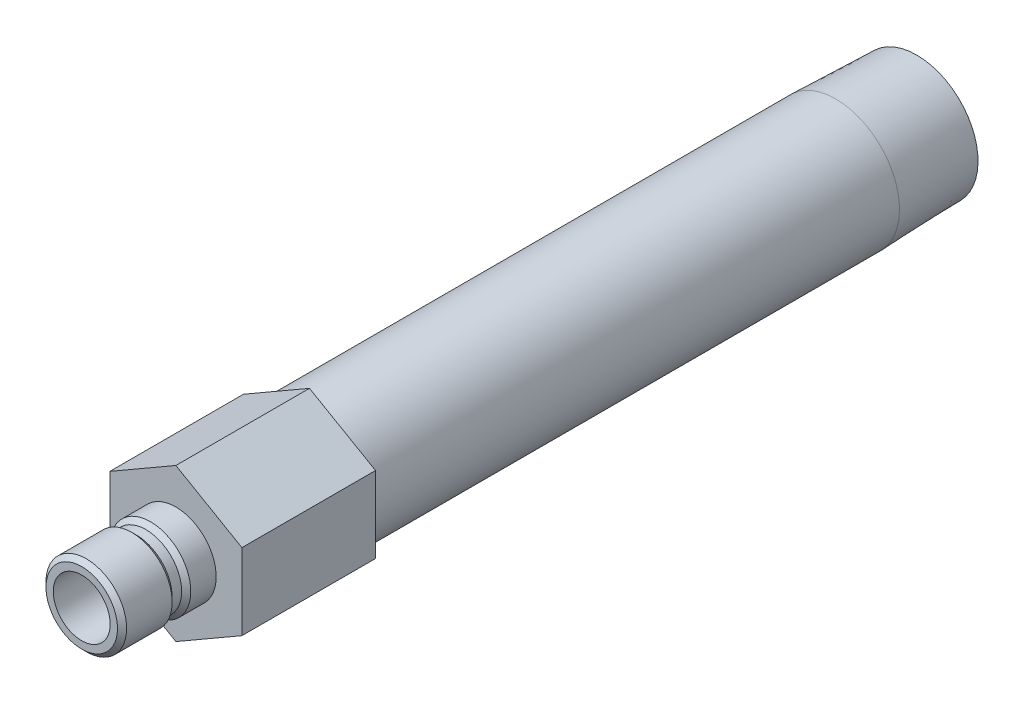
from build123d import *

# Parameters (mm, degrees)
SKETCH2_R           = 4.7625
BOSS_EXTRUDE1_DEPTH = 22.352


with BuildPart() as part:
    # Sketch1 → Revolve1 (revolve)
    with BuildSketch(Plane(origin=(0, 0, 0), x_dir=(0, 0, -1), z_dir=(1, 0, 0))):
        Polygon((-15.748, 4.7625), (-15.748, 5.9817), (-14.986, 6.7437), (-7.366, 6.7437), (-6.604, 5.9817), (-5.0165, 5.9817), (-4.2545, 6.7437), (0, 6.7437), (0, 10.668), (110.3884, 10.668), (123.952, 10.244140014), (123.952, 7.8994), (22.352, 7.8994), (22.352, 4.7625), align=None)
    revolve(axis=Axis((0, 0, 0), (0, 0, 1)))

    # Sketch2 → Boss-Extrude1 (add)
    with BuildSketch(Plane.XY):
        Polygon((-11.049, 6.379143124), (-11.049, -6.379143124), (0, -12.758286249), (11.049, -6.379143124), (11.049, 6.379143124), (0, 12.758286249), align=None)
        with Locations(Location((0, 0, 0), (0, 0, 90))):
            Circle(SKETCH2_R, mode=Mode.SUBTRACT)
    extrude(amount=-BOSS_EXTRUDE1_DEPTH)


solid = part.part
